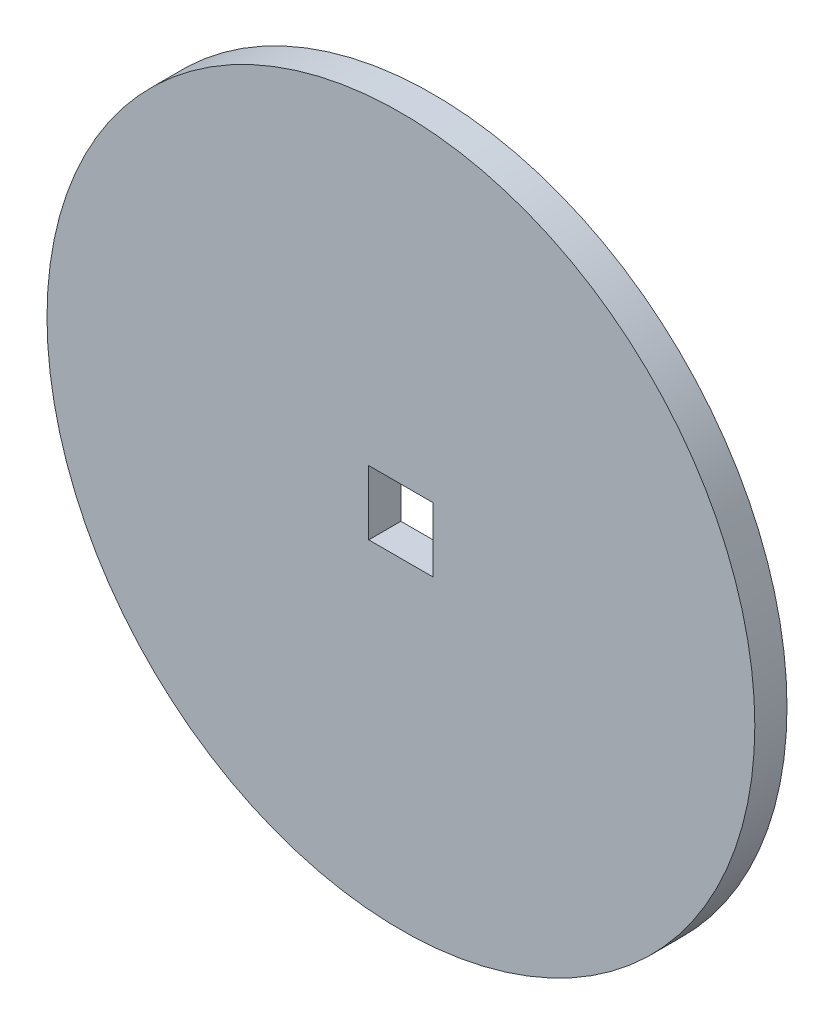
ISO-10303-21;
HEADER;
FILE_DESCRIPTION(('STEP AP214'),'2;1');
FILE_NAME('part.step','',(''),(''),'','','');
FILE_SCHEMA(('AUTOMOTIVE_DESIGN { 1 0 10303 214 1 1 1 1 }'));
ENDSEC;
DATA;
#1=APPLICATION_CONTEXT('core data for automotive mechanical design processes');
#2=APPLICATION_PROTOCOL_DEFINITION('international standard','automotive_design',2000,#1);
#3=PRODUCT_CONTEXT('',#1,'mechanical');
#4=PRODUCT('Part','Part','',(#3));
#5=PRODUCT_RELATED_PRODUCT_CATEGORY('part','',(#4));
#6=PRODUCT_DEFINITION_FORMATION('','',#4);
#7=PRODUCT_DEFINITION_CONTEXT('part definition',#1,'design');
#8=PRODUCT_DEFINITION('design','',#6,#7);
#9=PRODUCT_DEFINITION_SHAPE('','',#8);
#10=(LENGTH_UNIT() NAMED_UNIT(*) SI_UNIT(.MILLI.,.METRE.));
#11=(NAMED_UNIT(*) PLANE_ANGLE_UNIT() SI_UNIT($,.RADIAN.));
#12=(NAMED_UNIT(*) SI_UNIT($,.STERADIAN.) SOLID_ANGLE_UNIT());
#13=UNCERTAINTY_MEASURE_WITH_UNIT(LENGTH_MEASURE(1.E-05),#10,'distance_accuracy_value','');
#14=(GEOMETRIC_REPRESENTATION_CONTEXT(3) GLOBAL_UNCERTAINTY_ASSIGNED_CONTEXT((#13)) GLOBAL_UNIT_ASSIGNED_CONTEXT((#10,
#11,#12)) REPRESENTATION_CONTEXT('',''));
#15=CARTESIAN_POINT('',(0.,0.,0.));
#16=DIRECTION('',(0.,0.,1.));
#17=DIRECTION('',(1.,0.,0.));
#18=AXIS2_PLACEMENT_3D('',#15,#16,#17);
#19=CARTESIAN_POINT('',(-50.8684183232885,26.444772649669,3.175));
#20=DIRECTION('',(0.,0.,1.));
#21=DIRECTION('',(1.,0.,0.));
#22=AXIS2_PLACEMENT_3D('',#19,#20,#21);
#23=PLANE('',#22);
#24=CARTESIAN_POINT('',(-50.8684183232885,26.444772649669,3.175));
#25=DIRECTION('',(0.,0.,1.));
#26=DIRECTION('',(1.,0.,0.));
#27=AXIS2_PLACEMENT_3D('',#24,#25,#26);
#28=CIRCLE('',#27,34.925);
#29=CARTESIAN_POINT('',(-15.9434183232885,26.444772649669,3.175));
#30=VERTEX_POINT('',#29);
#31=EDGE_CURVE('E11',#30,#30,#28,.T.);
#32=ORIENTED_EDGE('',*,*,#31,.T.);
#33=EDGE_LOOP('',(#32));
#34=FACE_BOUND('',#33,.T.);
#35=DIRECTION('',(-1.,0.,0.));
#36=VECTOR('',#35,1.);
#37=CARTESIAN_POINT('',(-54.0434183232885,29.619772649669,3.175));
#38=LINE('',#37,#36);
#39=CARTESIAN_POINT('',(-47.6934183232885,29.619772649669,3.175));
#40=VERTEX_POINT('',#39);
#41=CARTESIAN_POINT('',(-54.0434183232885,29.619772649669,3.175));
#42=VERTEX_POINT('',#41);
#43=EDGE_CURVE('E82',#40,#42,#38,.T.);
#44=ORIENTED_EDGE('',*,*,#43,.F.);
#45=DIRECTION('',(0.,1.,0.));
#46=VECTOR('',#45,1.);
#47=CARTESIAN_POINT('',(-47.6934183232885,23.269772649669,3.175));
#48=LINE('',#47,#46);
#49=CARTESIAN_POINT('',(-47.6934183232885,23.269772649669,3.175));
#50=VERTEX_POINT('',#49);
#51=EDGE_CURVE('E74',#50,#40,#48,.T.);
#52=ORIENTED_EDGE('',*,*,#51,.F.);
#53=DIRECTION('',(1.,0.,0.));
#54=VECTOR('',#53,1.);
#55=CARTESIAN_POINT('',(-54.0434183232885,23.269772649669,3.175));
#56=LINE('',#55,#54);
#57=CARTESIAN_POINT('',(-54.0434183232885,23.269772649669,3.175));
#58=VERTEX_POINT('',#57);
#59=EDGE_CURVE('E95',#58,#50,#56,.T.);
#60=ORIENTED_EDGE('',*,*,#59,.F.);
#61=DIRECTION('',(0.,-1.,0.));
#62=VECTOR('',#61,1.);
#63=CARTESIAN_POINT('',(-54.0434183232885,23.269772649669,3.175));
#64=LINE('',#63,#62);
#65=EDGE_CURVE('E93',#42,#58,#64,.T.);
#66=ORIENTED_EDGE('',*,*,#65,.F.);
#67=EDGE_LOOP('',(#44,#52,#60,#66));
#68=FACE_BOUND('',#67,.T.);
#69=ADVANCED_FACE('F33',(#34,#68),#23,.T.);
#70=CARTESIAN_POINT('',(-50.8684183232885,26.444772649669,0.));
#71=DIRECTION('',(0.,0.,1.));
#72=DIRECTION('',(1.,0.,0.));
#73=AXIS2_PLACEMENT_3D('',#70,#71,#72);
#74=PLANE('',#73);
#75=CARTESIAN_POINT('',(-50.8684183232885,26.444772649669,0.));
#76=DIRECTION('',(0.,0.,1.));
#77=DIRECTION('',(1.,0.,0.));
#78=AXIS2_PLACEMENT_3D('',#75,#76,#77);
#79=CIRCLE('',#78,34.925);
#80=CARTESIAN_POINT('',(-15.9434183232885,26.444772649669,0.));
#81=VERTEX_POINT('',#80);
#82=EDGE_CURVE('E37',#81,#81,#79,.T.);
#83=ORIENTED_EDGE('',*,*,#82,.F.);
#84=EDGE_LOOP('',(#83));
#85=FACE_BOUND('',#84,.T.);
#86=DIRECTION('',(0.,1.,0.));
#87=VECTOR('',#86,1.);
#88=CARTESIAN_POINT('',(-47.6934183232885,23.269772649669,0.));
#89=LINE('',#88,#87);
#90=CARTESIAN_POINT('',(-47.6934183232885,23.269772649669,0.));
#91=VERTEX_POINT('',#90);
#92=CARTESIAN_POINT('',(-47.6934183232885,29.619772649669,0.));
#93=VERTEX_POINT('',#92);
#94=EDGE_CURVE('E56',#91,#93,#89,.T.);
#95=ORIENTED_EDGE('',*,*,#94,.T.);
#96=DIRECTION('',(-1.,0.,0.));
#97=VECTOR('',#96,1.);
#98=CARTESIAN_POINT('',(-54.0434183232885,29.619772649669,0.));
#99=LINE('',#98,#97);
#100=CARTESIAN_POINT('',(-54.0434183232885,29.619772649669,0.));
#101=VERTEX_POINT('',#100);
#102=EDGE_CURVE('E89',#93,#101,#99,.T.);
#103=ORIENTED_EDGE('',*,*,#102,.T.);
#104=DIRECTION('',(0.,-1.,0.));
#105=VECTOR('',#104,1.);
#106=CARTESIAN_POINT('',(-54.0434183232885,23.269772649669,0.));
#107=LINE('',#106,#105);
#108=CARTESIAN_POINT('',(-54.0434183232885,23.269772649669,0.));
#109=VERTEX_POINT('',#108);
#110=EDGE_CURVE('E101',#101,#109,#107,.T.);
#111=ORIENTED_EDGE('',*,*,#110,.T.);
#112=DIRECTION('',(1.,0.,0.));
#113=VECTOR('',#112,1.);
#114=CARTESIAN_POINT('',(-54.0434183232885,23.269772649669,0.));
#115=LINE('',#114,#113);
#116=EDGE_CURVE('E83',#109,#91,#115,.T.);
#117=ORIENTED_EDGE('',*,*,#116,.T.);
#118=EDGE_LOOP('',(#95,#103,#111,#117));
#119=FACE_BOUND('',#118,.T.);
#120=ADVANCED_FACE('F112',(#85,#119),#74,.F.);
#121=CARTESIAN_POINT('',(-50.8684183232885,26.444772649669,3.175));
#122=DIRECTION('',(0.,0.,-1.));
#123=DIRECTION('',(-1.,0.,0.));
#124=AXIS2_PLACEMENT_3D('',#121,#122,#123);
#125=CYLINDRICAL_SURFACE('',#124,34.925);
#126=ORIENTED_EDGE('',*,*,#31,.F.);
#127=EDGE_LOOP('',(#126));
#128=FACE_BOUND('',#127,.T.);
#129=ORIENTED_EDGE('',*,*,#82,.T.);
#130=EDGE_LOOP('',(#129));
#131=FACE_BOUND('',#130,.T.);
#132=ADVANCED_FACE('F35',(#128,#131),#125,.T.);
#133=CARTESIAN_POINT('',(-47.6934183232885,23.269772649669,3.175));
#134=DIRECTION('',(-1.,0.,0.));
#135=DIRECTION('',(0.,0.,1.));
#136=AXIS2_PLACEMENT_3D('',#133,#134,#135);
#137=PLANE('',#136);
#138=ORIENTED_EDGE('',*,*,#94,.F.);
#139=DIRECTION('',(0.,0.,-1.));
#140=VECTOR('',#139,1.);
#141=CARTESIAN_POINT('',(-47.6934183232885,23.269772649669,3.175));
#142=LINE('',#141,#140);
#143=EDGE_CURVE('E78',#50,#91,#142,.T.);
#144=ORIENTED_EDGE('',*,*,#143,.F.);
#145=ORIENTED_EDGE('',*,*,#51,.T.);
#146=DIRECTION('',(0.,0.,-1.));
#147=VECTOR('',#146,1.);
#148=CARTESIAN_POINT('',(-47.6934183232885,29.619772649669,3.175));
#149=LINE('',#148,#147);
#150=EDGE_CURVE('E77',#40,#93,#149,.T.);
#151=ORIENTED_EDGE('',*,*,#150,.T.);
#152=EDGE_LOOP('',(#138,#144,#145,#151));
#153=FACE_BOUND('',#152,.T.);
#154=ADVANCED_FACE('F76',(#153),#137,.T.);
#155=CARTESIAN_POINT('',(-54.0434183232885,29.619772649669,3.175));
#156=DIRECTION('',(0.,-1.,0.));
#157=DIRECTION('',(0.,0.,-1.));
#158=AXIS2_PLACEMENT_3D('',#155,#156,#157);
#159=PLANE('',#158);
#160=ORIENTED_EDGE('',*,*,#102,.F.);
#161=ORIENTED_EDGE('',*,*,#150,.F.);
#162=ORIENTED_EDGE('',*,*,#43,.T.);
#163=DIRECTION('',(0.,0.,-1.));
#164=VECTOR('',#163,1.);
#165=CARTESIAN_POINT('',(-54.0434183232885,29.619772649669,3.175));
#166=LINE('',#165,#164);
#167=EDGE_CURVE('E90',#42,#101,#166,.T.);
#168=ORIENTED_EDGE('',*,*,#167,.T.);
#169=EDGE_LOOP('',(#160,#161,#162,#168));
#170=FACE_BOUND('',#169,.T.);
#171=ADVANCED_FACE('F86',(#170),#159,.T.);
#172=CARTESIAN_POINT('',(-54.0434183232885,23.269772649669,3.175));
#173=DIRECTION('',(1.,0.,0.));
#174=DIRECTION('',(0.,0.,-1.));
#175=AXIS2_PLACEMENT_3D('',#172,#173,#174);
#176=PLANE('',#175);
#177=ORIENTED_EDGE('',*,*,#110,.F.);
#178=ORIENTED_EDGE('',*,*,#167,.F.);
#179=ORIENTED_EDGE('',*,*,#65,.T.);
#180=DIRECTION('',(0.,0.,-1.));
#181=VECTOR('',#180,1.);
#182=CARTESIAN_POINT('',(-54.0434183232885,23.269772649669,3.175));
#183=LINE('',#182,#181);
#184=EDGE_CURVE('E48',#58,#109,#183,.T.);
#185=ORIENTED_EDGE('',*,*,#184,.T.);
#186=EDGE_LOOP('',(#177,#178,#179,#185));
#187=FACE_BOUND('',#186,.T.);
#188=ADVANCED_FACE('F110',(#187),#176,.T.);
#189=CARTESIAN_POINT('',(-54.0434183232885,23.269772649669,3.175));
#190=DIRECTION('',(0.,1.,0.));
#191=DIRECTION('',(0.,0.,1.));
#192=AXIS2_PLACEMENT_3D('',#189,#190,#191);
#193=PLANE('',#192);
#194=ORIENTED_EDGE('',*,*,#116,.F.);
#195=ORIENTED_EDGE('',*,*,#184,.F.);
#196=ORIENTED_EDGE('',*,*,#59,.T.);
#197=ORIENTED_EDGE('',*,*,#143,.T.);
#198=EDGE_LOOP('',(#194,#195,#196,#197));
#199=FACE_BOUND('',#198,.T.);
#200=ADVANCED_FACE('F113',(#199),#193,.T.);
#201=CLOSED_SHELL('',(#69,#120,#132,#154,#171,#188,#200));
#202=MANIFOLD_SOLID_BREP('B2',#201);
#203=ADVANCED_BREP_SHAPE_REPRESENTATION('',(#18,#202),#14);
#204=SHAPE_DEFINITION_REPRESENTATION(#9,#203);
ENDSEC;
END-ISO-10303-21;
